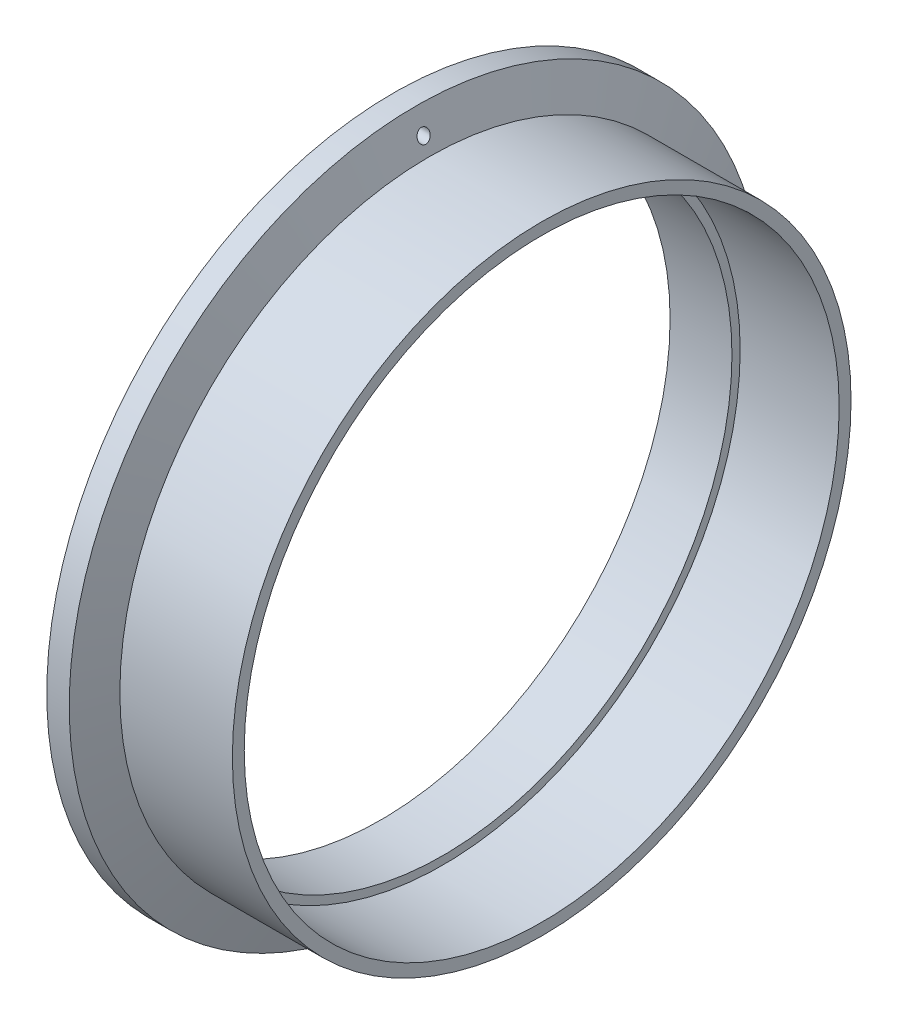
ISO-10303-21;
HEADER;
FILE_DESCRIPTION(('STEP AP214'),'2;1');
FILE_NAME('part.step','',(''),(''),'','','');
FILE_SCHEMA(('AUTOMOTIVE_DESIGN { 1 0 10303 214 1 1 1 1 }'));
ENDSEC;
DATA;
#1=APPLICATION_CONTEXT('core data for automotive mechanical design processes');
#2=APPLICATION_PROTOCOL_DEFINITION('international standard','automotive_design',2000,#1);
#3=PRODUCT_CONTEXT('',#1,'mechanical');
#4=PRODUCT('Part','Part','',(#3));
#5=PRODUCT_RELATED_PRODUCT_CATEGORY('part','',(#4));
#6=PRODUCT_DEFINITION_FORMATION('','',#4);
#7=PRODUCT_DEFINITION_CONTEXT('part definition',#1,'design');
#8=PRODUCT_DEFINITION('design','',#6,#7);
#9=PRODUCT_DEFINITION_SHAPE('','',#8);
#10=(LENGTH_UNIT() NAMED_UNIT(*) SI_UNIT(.MILLI.,.METRE.));
#11=(NAMED_UNIT(*) PLANE_ANGLE_UNIT() SI_UNIT($,.RADIAN.));
#12=(NAMED_UNIT(*) SI_UNIT($,.STERADIAN.) SOLID_ANGLE_UNIT());
#13=UNCERTAINTY_MEASURE_WITH_UNIT(LENGTH_MEASURE(1.E-05),#10,'distance_accuracy_value','');
#14=(GEOMETRIC_REPRESENTATION_CONTEXT(3) GLOBAL_UNCERTAINTY_ASSIGNED_CONTEXT((#13)) GLOBAL_UNIT_ASSIGNED_CONTEXT((#10,
#11,#12)) REPRESENTATION_CONTEXT('',''));
#15=CARTESIAN_POINT('',(0.,0.,0.));
#16=DIRECTION('',(0.,0.,1.));
#17=DIRECTION('',(1.,0.,0.));
#18=AXIS2_PLACEMENT_3D('',#15,#16,#17);
#19=CARTESIAN_POINT('',(9.23261648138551,0.,0.));
#20=DIRECTION('',(-1.,0.,0.));
#21=DIRECTION('',(0.,0.,1.));
#22=AXIS2_PLACEMENT_3D('',#19,#20,#21);
#23=CONICAL_SURFACE('',#22,79.375,1.22173047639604);
#24=CARTESIAN_POINT('',(7.36922350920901,84.4878991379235,-1.06649775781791));
#25=CARTESIAN_POINT('',(7.34869113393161,84.5451121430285,-1.00341214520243));
#26=CARTESIAN_POINT('',(7.32989380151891,84.597547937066,-0.935371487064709));
#27=CARTESIAN_POINT('',(7.2963757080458,84.6911155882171,-0.790952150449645));
#28=CARTESIAN_POINT('',(7.28165724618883,84.7322410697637,-0.714568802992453));
#29=CARTESIAN_POINT('',(7.25679867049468,84.8017340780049,-0.555340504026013));
#30=CARTESIAN_POINT('',(7.24666584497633,84.8300812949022,-0.472485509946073));
#31=CARTESIAN_POINT('',(7.23139832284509,84.8728039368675,-0.302814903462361));
#32=CARTESIAN_POINT('',(7.22626236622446,84.8871828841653,-0.216000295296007));
#33=CARTESIAN_POINT('',(7.221261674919,84.9011831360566,-0.0436522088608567));
#34=CARTESIAN_POINT('',(7.22124444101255,84.9012313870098,0.0418423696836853));
#35=CARTESIAN_POINT('',(7.22609982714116,84.8876379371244,0.211588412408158));
#36=CARTESIAN_POINT('',(7.23097208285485,84.8739972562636,0.295839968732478));
#37=CARTESIAN_POINT('',(7.24534361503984,84.8337807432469,0.4597651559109));
#38=CARTESIAN_POINT('',(7.25479061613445,84.8073510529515,0.539479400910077));
#39=CARTESIAN_POINT('',(7.27795946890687,84.742575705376,0.693232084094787));
#40=CARTESIAN_POINT('',(7.29168166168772,84.704229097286,0.767270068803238));
#41=CARTESIAN_POINT('',(7.32335923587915,84.6157826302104,0.909676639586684));
#42=CARTESIAN_POINT('',(7.34141406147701,84.5654068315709,0.977851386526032));
#43=CARTESIAN_POINT('',(7.38099316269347,84.4550918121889,1.10479578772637));
#44=CARTESIAN_POINT('',(7.402518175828,84.3951505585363,1.16356343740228));
#45=CARTESIAN_POINT('',(7.44961064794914,84.2641685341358,1.2732622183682));
#46=CARTESIAN_POINT('',(7.47532880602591,84.1927161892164,1.32363691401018));
#47=CARTESIAN_POINT('',(7.52920591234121,84.0432382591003,1.4117292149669));
#48=CARTESIAN_POINT('',(7.55736551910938,83.9652109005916,1.44944339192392));
#49=CARTESIAN_POINT('',(7.61707116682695,83.8000173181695,1.51336732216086));
#50=CARTESIAN_POINT('',(7.64871881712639,83.7125835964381,1.53879171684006));
#51=CARTESIAN_POINT('',(7.71308713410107,83.5350403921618,1.57436072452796));
#52=CARTESIAN_POINT('',(7.74580806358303,83.4449302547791,1.58450156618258));
#53=CARTESIAN_POINT('',(7.81283791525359,83.2606396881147,1.5894525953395));
#54=CARTESIAN_POINT('',(7.84715664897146,83.1664447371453,1.58361289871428));
#55=CARTESIAN_POINT('',(7.91508736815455,82.9803079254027,1.55531366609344));
#56=CARTESIAN_POINT('',(7.94869926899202,82.8883663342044,1.53285215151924));
#57=CARTESIAN_POINT('',(8.01444716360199,82.7088084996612,1.47152056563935));
#58=CARTESIAN_POINT('',(8.04657235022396,82.621223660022,1.43254652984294));
#59=CARTESIAN_POINT('',(8.10808372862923,82.4537699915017,1.3389520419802));
#60=CARTESIAN_POINT('',(8.13747029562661,82.3739001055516,1.28433373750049));
#61=CARTESIAN_POINT('',(8.1915046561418,82.2272302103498,1.1628348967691));
#62=CARTESIAN_POINT('',(8.21628079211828,82.1600748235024,1.0964414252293));
#63=CARTESIAN_POINT('',(8.26135439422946,82.038029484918,0.951888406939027));
#64=CARTESIAN_POINT('',(8.28165362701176,81.9831346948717,0.873733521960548));
#65=CARTESIAN_POINT('',(8.3158286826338,81.8907864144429,0.713000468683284));
#66=CARTESIAN_POINT('',(8.3300211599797,81.8524722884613,0.630984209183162));
#67=CARTESIAN_POINT('',(8.35309530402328,81.7902093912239,0.460970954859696));
#68=CARTESIAN_POINT('',(8.36197910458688,81.7662548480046,0.372976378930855));
#69=CARTESIAN_POINT('',(8.37369088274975,81.7346801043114,0.198964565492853));
#70=CARTESIAN_POINT('',(8.37683716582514,81.7262013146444,0.113123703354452));
#71=CARTESIAN_POINT('',(8.37792736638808,81.7232630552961,-0.0588232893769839));
#72=CARTESIAN_POINT('',(8.37587227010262,81.7288009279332,-0.144929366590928));
#73=CARTESIAN_POINT('',(8.36676581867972,81.7533491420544,-0.312682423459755));
#74=CARTESIAN_POINT('',(8.35984194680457,81.7720157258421,-0.394387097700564));
#75=CARTESIAN_POINT('',(8.34140807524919,81.8217422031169,-0.553377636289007));
#76=CARTESIAN_POINT('',(8.32989790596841,81.8528025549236,-0.630663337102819));
#77=CARTESIAN_POINT('',(8.30248354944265,81.9268396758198,-0.780100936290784));
#78=CARTESIAN_POINT('',(8.28650882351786,81.9700077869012,-0.852144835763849));
#79=CARTESIAN_POINT('',(8.25080533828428,82.066585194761,-0.98795024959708));
#80=CARTESIAN_POINT('',(8.23107583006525,82.1199965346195,-1.0517101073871));
#81=CARTESIAN_POINT('',(8.18742487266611,82.2383046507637,-1.17253140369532));
#82=CARTESIAN_POINT('',(8.16334475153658,82.3036377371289,-1.22910786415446));
#83=CARTESIAN_POINT('',(8.11246185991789,82.4418779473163,-1.33056431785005));
#84=CARTESIAN_POINT('',(8.08565833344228,82.5147871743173,-1.37544105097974));
#85=CARTESIAN_POINT('',(8.02836683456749,82.6708541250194,-1.45506698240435));
#86=CARTESIAN_POINT('',(7.9977539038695,82.7543655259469,-1.48903354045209));
#87=CARTESIAN_POINT('',(7.93514322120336,82.925440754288,-1.54232312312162));
#88=CARTESIAN_POINT('',(7.90314515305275,83.0130055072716,-1.56164278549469));
#89=CARTESIAN_POINT('',(7.83705065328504,83.1941723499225,-1.58588040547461));
#90=CARTESIAN_POINT('',(7.80292698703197,83.287863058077,-1.59006655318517));
#91=CARTESIAN_POINT('',(7.7350001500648,83.4746793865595,-1.58190932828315));
#92=CARTESIAN_POINT('',(7.70119710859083,83.567804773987,-1.56955955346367));
#93=CARTESIAN_POINT('',(7.63436071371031,83.7522334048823,-1.5282070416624));
#94=CARTESIAN_POINT('',(7.6013464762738,83.8434884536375,-1.49895760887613));
#95=CARTESIAN_POINT('',(7.53763832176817,84.0198539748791,-1.42416664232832));
#96=CARTESIAN_POINT('',(7.50694158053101,84.1049719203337,-1.37864533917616));
#97=CARTESIAN_POINT('',(7.45804037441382,84.2407522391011,-1.28916530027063));
#98=CARTESIAN_POINT('',(7.43895321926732,84.2938041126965,-1.2492568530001));
#99=CARTESIAN_POINT('',(7.40262690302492,84.3948569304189,-1.16275470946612));
#100=CARTESIAN_POINT('',(7.38538755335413,84.4428583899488,-1.11616169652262));
#101=CARTESIAN_POINT('',(7.36922350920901,84.4878991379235,-1.06649775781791));
#102=B_SPLINE_CURVE_WITH_KNOTS('',3,(#24,#25,#26,#27,#28,#29,#30,#31,#32,#33,#34,#35,#36,#37,
#38,#39,#40,#41,#42,#43,#44,#45,#46,#47,#48,#49,#50,#51,#52,#53,#54,#55,#56,#57,#58,#59,#60,#61,
#62,#63,#64,#65,#66,#67,#68,#69,#70,#71,#72,#73,#74,#75,#76,#77,#78,#79,#80,#81,#82,#83,#84,#85,
#86,#87,#88,#89,#90,#91,#92,#93,#94,#95,#96,#97,#98,#99,#100,#101),.UNSPECIFIED.,.T.,.F.,(4,2,2,
2,2,2,2,2,2,2,2,2,2,2,2,2,2,2,2,2,2,2,2,2,2,2,2,2,2,2,2,2,2,2,2,2,2,2,4),(0.,0.262582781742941,
0.525313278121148,0.78845989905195,1.05154014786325,1.30678178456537,1.56200440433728,
1.81437706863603,2.06676987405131,2.32562876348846,2.58454274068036,2.85673459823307,
3.12900010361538,3.41690646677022,3.70488386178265,4.0047445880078,4.30464101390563,
4.60645435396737,4.90822628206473,5.1996057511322,5.49087003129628,5.76434061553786,
6.0377012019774,6.29537245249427,6.55299484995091,6.8041113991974,7.05523723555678,
7.31057996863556,7.56597368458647,7.83395394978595,8.10200880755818,8.38637847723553,
8.67081340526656,8.96883147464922,9.26696496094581,9.56956459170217,9.87178930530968,
10.0785278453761,10.2852452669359),.UNSPECIFIED.);
#103=CARTESIAN_POINT('',(7.36922350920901,84.4878991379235,-1.06649775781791));
#104=VERTEX_POINT('',#103);
#105=EDGE_CURVE('E83',#104,#104,#102,.T.);
#106=ORIENTED_EDGE('',*,*,#105,.F.);
#107=EDGE_LOOP('',(#106));
#108=FACE_BOUND('',#107,.T.);
#109=CARTESIAN_POINT('',(5.7658,0.,0.));
#110=DIRECTION('',(1.,0.,0.));
#111=DIRECTION('',(0.,0.,-1.));
#112=AXIS2_PLACEMENT_3D('',#109,#110,#111);
#113=CIRCLE('',#112,88.9);
#114=CARTESIAN_POINT('',(5.7658,0.,-88.9));
#115=VERTEX_POINT('',#114);
#116=EDGE_CURVE('E10',#115,#115,#113,.T.);
#117=ORIENTED_EDGE('',*,*,#116,.T.);
#118=EDGE_LOOP('',(#117));
#119=FACE_BOUND('',#118,.T.);
#120=CARTESIAN_POINT('',(9.23261648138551,0.,0.));
#121=DIRECTION('',(1.,0.,0.));
#122=DIRECTION('',(0.,0.,-1.));
#123=AXIS2_PLACEMENT_3D('',#120,#121,#122);
#124=CIRCLE('',#123,79.375);
#125=CARTESIAN_POINT('',(9.23261648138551,0.,-79.375));
#126=VERTEX_POINT('',#125);
#127=EDGE_CURVE('E80',#126,#126,#124,.T.);
#128=ORIENTED_EDGE('',*,*,#127,.F.);
#129=EDGE_LOOP('',(#128));
#130=FACE_BOUND('',#129,.T.);
#131=ADVANCED_FACE('F36',(#108,#119,#130),#23,.T.);
#132=CARTESIAN_POINT('',(24.3299607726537,0.,0.));
#133=DIRECTION('',(1.,0.,0.));
#134=DIRECTION('',(0.,0.,-1.));
#135=AXIS2_PLACEMENT_3D('',#132,#133,#134);
#136=CYLINDRICAL_SURFACE('',#135,88.9);
#137=CARTESIAN_POINT('',(0.,0.,0.));
#138=DIRECTION('',(1.,0.,0.));
#139=DIRECTION('',(0.,0.,-1.));
#140=AXIS2_PLACEMENT_3D('',#137,#138,#139);
#141=CIRCLE('',#140,88.9);
#142=CARTESIAN_POINT('',(0.,0.,-88.9));
#143=VERTEX_POINT('',#142);
#144=EDGE_CURVE('E43',#143,#143,#141,.T.);
#145=ORIENTED_EDGE('',*,*,#144,.T.);
#146=EDGE_LOOP('',(#145));
#147=FACE_BOUND('',#146,.T.);
#148=ORIENTED_EDGE('',*,*,#116,.F.);
#149=EDGE_LOOP('',(#148));
#150=FACE_BOUND('',#149,.T.);
#151=ADVANCED_FACE('F137',(#147,#150),#136,.T.);
#152=CARTESIAN_POINT('',(0.,88.9,0.));
#153=DIRECTION('',(-1.,0.,0.));
#154=DIRECTION('',(0.,0.,1.));
#155=AXIS2_PLACEMENT_3D('',#152,#153,#154);
#156=PLANE('',#155);
#157=CARTESIAN_POINT('',(0.,83.312,0.));
#158=DIRECTION('',(-1.,0.,0.));
#159=DIRECTION('',(0.,0.,1.));
#160=AXIS2_PLACEMENT_3D('',#157,#158,#159);
#161=CIRCLE('',#160,1.5875);
#162=CARTESIAN_POINT('',(0.,83.312,1.5875));
#163=VERTEX_POINT('',#162);
#164=EDGE_CURVE('E89',#163,#163,#161,.T.);
#165=ORIENTED_EDGE('',*,*,#164,.F.);
#166=EDGE_LOOP('',(#165));
#167=FACE_BOUND('',#166,.T.);
#168=CARTESIAN_POINT('',(0.,0.,0.));
#169=DIRECTION('',(1.,0.,0.));
#170=DIRECTION('',(0.,0.,-1.));
#171=AXIS2_PLACEMENT_3D('',#168,#169,#170);
#172=CIRCLE('',#171,80.137);
#173=CARTESIAN_POINT('',(0.,0.,-80.137));
#174=VERTEX_POINT('',#173);
#175=EDGE_CURVE('E47',#174,#174,#172,.T.);
#176=ORIENTED_EDGE('',*,*,#175,.T.);
#177=EDGE_LOOP('',(#176));
#178=FACE_BOUND('',#177,.T.);
#179=ORIENTED_EDGE('',*,*,#144,.F.);
#180=EDGE_LOOP('',(#179));
#181=FACE_BOUND('',#180,.T.);
#182=ADVANCED_FACE('F134',(#167,#178,#181),#156,.T.);
#183=CARTESIAN_POINT('',(24.3299607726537,0.,0.));
#184=DIRECTION('',(1.,0.,0.));
#185=DIRECTION('',(0.,0.,-1.));
#186=AXIS2_PLACEMENT_3D('',#183,#184,#185);
#187=CYLINDRICAL_SURFACE('',#186,80.137);
#188=CARTESIAN_POINT('',(2.667,0.,0.));
#189=DIRECTION('',(1.,0.,0.));
#190=DIRECTION('',(0.,0.,-1.));
#191=AXIS2_PLACEMENT_3D('',#188,#189,#190);
#192=CIRCLE('',#191,80.137);
#193=CARTESIAN_POINT('',(2.667,0.,-80.137));
#194=VERTEX_POINT('',#193);
#195=EDGE_CURVE('E51',#194,#194,#192,.T.);
#196=ORIENTED_EDGE('',*,*,#195,.T.);
#197=EDGE_LOOP('',(#196));
#198=FACE_BOUND('',#197,.T.);
#199=ORIENTED_EDGE('',*,*,#175,.F.);
#200=EDGE_LOOP('',(#199));
#201=FACE_BOUND('',#200,.T.);
#202=ADVANCED_FACE('F130',(#198,#201),#187,.F.);
#203=CARTESIAN_POINT('',(2.667,76.073,0.));
#204=DIRECTION('',(-1.,0.,0.));
#205=DIRECTION('',(0.,0.,1.));
#206=AXIS2_PLACEMENT_3D('',#203,#204,#205);
#207=PLANE('',#206);
#208=CARTESIAN_POINT('',(2.667,0.,0.));
#209=DIRECTION('',(1.,0.,0.));
#210=DIRECTION('',(0.,0.,-1.));
#211=AXIS2_PLACEMENT_3D('',#208,#209,#210);
#212=CIRCLE('',#211,76.073);
#213=CARTESIAN_POINT('',(2.667,0.,-76.073));
#214=VERTEX_POINT('',#213);
#215=EDGE_CURVE('E56',#214,#214,#212,.T.);
#216=ORIENTED_EDGE('',*,*,#215,.T.);
#217=EDGE_LOOP('',(#216));
#218=FACE_BOUND('',#217,.T.);
#219=ORIENTED_EDGE('',*,*,#195,.F.);
#220=EDGE_LOOP('',(#219));
#221=FACE_BOUND('',#220,.T.);
#222=ADVANCED_FACE('F126',(#218,#221),#207,.T.);
#223=CARTESIAN_POINT('',(24.3299607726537,0.,0.));
#224=DIRECTION('',(1.,0.,0.));
#225=DIRECTION('',(0.,0.,-1.));
#226=AXIS2_PLACEMENT_3D('',#223,#224,#225);
#227=CYLINDRICAL_SURFACE('',#226,76.073);
#228=CARTESIAN_POINT('',(-2.667,0.,0.));
#229=DIRECTION('',(1.,0.,0.));
#230=DIRECTION('',(0.,0.,-1.));
#231=AXIS2_PLACEMENT_3D('',#228,#229,#230);
#232=CIRCLE('',#231,76.073);
#233=CARTESIAN_POINT('',(-2.667,0.,-76.073));
#234=VERTEX_POINT('',#233);
#235=EDGE_CURVE('E59',#234,#234,#232,.T.);
#236=ORIENTED_EDGE('',*,*,#235,.T.);
#237=EDGE_LOOP('',(#236));
#238=FACE_BOUND('',#237,.T.);
#239=ORIENTED_EDGE('',*,*,#215,.F.);
#240=EDGE_LOOP('',(#239));
#241=FACE_BOUND('',#240,.T.);
#242=ADVANCED_FACE('F122',(#238,#241),#227,.T.);
#243=CARTESIAN_POINT('',(-2.667,0.,0.));
#244=DIRECTION('',(1.,0.,0.));
#245=DIRECTION('',(0.,0.,-1.));
#246=AXIS2_PLACEMENT_3D('',#243,#244,#245);
#247=CONICAL_SURFACE('',#246,76.073,0.785398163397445);
#248=CARTESIAN_POINT('',(-3.175,0.,0.));
#249=DIRECTION('',(1.,0.,0.));
#250=DIRECTION('',(0.,0.,-1.));
#251=AXIS2_PLACEMENT_3D('',#248,#249,#250);
#252=CIRCLE('',#251,75.565);
#253=CARTESIAN_POINT('',(-3.175,0.,-75.565));
#254=VERTEX_POINT('',#253);
#255=EDGE_CURVE('E62',#254,#254,#252,.T.);
#256=ORIENTED_EDGE('',*,*,#255,.T.);
#257=EDGE_LOOP('',(#256));
#258=FACE_BOUND('',#257,.T.);
#259=ORIENTED_EDGE('',*,*,#235,.F.);
#260=EDGE_LOOP('',(#259));
#261=FACE_BOUND('',#260,.T.);
#262=ADVANCED_FACE('F118',(#258,#261),#247,.T.);
#263=CARTESIAN_POINT('',(-3.175,75.565,0.));
#264=DIRECTION('',(-1.,0.,0.));
#265=DIRECTION('',(0.,0.,1.));
#266=AXIS2_PLACEMENT_3D('',#263,#264,#265);
#267=PLANE('',#266);
#268=CARTESIAN_POINT('',(-3.175,0.,0.));
#269=DIRECTION('',(1.,0.,0.));
#270=DIRECTION('',(0.,0.,-1.));
#271=AXIS2_PLACEMENT_3D('',#268,#269,#270);
#272=CIRCLE('',#271,74.2188);
#273=CARTESIAN_POINT('',(-3.175,0.,-74.2188));
#274=VERTEX_POINT('',#273);
#275=EDGE_CURVE('E65',#274,#274,#272,.T.);
#276=ORIENTED_EDGE('',*,*,#275,.T.);
#277=EDGE_LOOP('',(#276));
#278=FACE_BOUND('',#277,.T.);
#279=ORIENTED_EDGE('',*,*,#255,.F.);
#280=EDGE_LOOP('',(#279));
#281=FACE_BOUND('',#280,.T.);
#282=ADVANCED_FACE('F114',(#278,#281),#267,.T.);
#283=CARTESIAN_POINT('',(24.3299607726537,0.,0.));
#284=DIRECTION('',(1.,0.,0.));
#285=DIRECTION('',(0.,0.,-1.));
#286=AXIS2_PLACEMENT_3D('',#283,#284,#285);
#287=CYLINDRICAL_SURFACE('',#286,74.2188);
#288=CARTESIAN_POINT('',(12.7,0.,0.));
#289=DIRECTION('',(1.,0.,0.));
#290=DIRECTION('',(0.,0.,-1.));
#291=AXIS2_PLACEMENT_3D('',#288,#289,#290);
#292=CIRCLE('',#291,74.2188);
#293=CARTESIAN_POINT('',(12.7,0.,-74.2188));
#294=VERTEX_POINT('',#293);
#295=EDGE_CURVE('E68',#294,#294,#292,.T.);
#296=ORIENTED_EDGE('',*,*,#295,.T.);
#297=EDGE_LOOP('',(#296));
#298=FACE_BOUND('',#297,.T.);
#299=ORIENTED_EDGE('',*,*,#275,.F.);
#300=EDGE_LOOP('',(#299));
#301=FACE_BOUND('',#300,.T.);
#302=ADVANCED_FACE('F110',(#298,#301),#287,.F.);
#303=CARTESIAN_POINT('',(12.7,76.327,0.));
#304=DIRECTION('',(1.,0.,0.));
#305=DIRECTION('',(0.,0.,-1.));
#306=AXIS2_PLACEMENT_3D('',#303,#304,#305);
#307=PLANE('',#306);
#308=CARTESIAN_POINT('',(12.7,0.,0.));
#309=DIRECTION('',(1.,0.,0.));
#310=DIRECTION('',(0.,0.,-1.));
#311=AXIS2_PLACEMENT_3D('',#308,#309,#310);
#312=CIRCLE('',#311,76.327);
#313=CARTESIAN_POINT('',(12.7,0.,-76.327));
#314=VERTEX_POINT('',#313);
#315=EDGE_CURVE('E71',#314,#314,#312,.T.);
#316=ORIENTED_EDGE('',*,*,#315,.T.);
#317=EDGE_LOOP('',(#316));
#318=FACE_BOUND('',#317,.T.);
#319=ORIENTED_EDGE('',*,*,#295,.F.);
#320=EDGE_LOOP('',(#319));
#321=FACE_BOUND('',#320,.T.);
#322=ADVANCED_FACE('F106',(#318,#321),#307,.T.);
#323=CARTESIAN_POINT('',(24.3299607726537,0.,0.));
#324=DIRECTION('',(1.,0.,0.));
#325=DIRECTION('',(0.,0.,-1.));
#326=AXIS2_PLACEMENT_3D('',#323,#324,#325);
#327=CYLINDRICAL_SURFACE('',#326,76.327);
#328=CARTESIAN_POINT('',(38.1,0.,0.));
#329=DIRECTION('',(1.,0.,0.));
#330=DIRECTION('',(0.,0.,-1.));
#331=AXIS2_PLACEMENT_3D('',#328,#329,#330);
#332=CIRCLE('',#331,76.327);
#333=CARTESIAN_POINT('',(38.1,0.,-76.327));
#334=VERTEX_POINT('',#333);
#335=EDGE_CURVE('E74',#334,#334,#332,.T.);
#336=ORIENTED_EDGE('',*,*,#335,.T.);
#337=EDGE_LOOP('',(#336));
#338=FACE_BOUND('',#337,.T.);
#339=ORIENTED_EDGE('',*,*,#315,.F.);
#340=EDGE_LOOP('',(#339));
#341=FACE_BOUND('',#340,.T.);
#342=ADVANCED_FACE('F102',(#338,#341),#327,.F.);
#343=CARTESIAN_POINT('',(38.1,76.327,0.));
#344=DIRECTION('',(1.,0.,0.));
#345=DIRECTION('',(0.,0.,-1.));
#346=AXIS2_PLACEMENT_3D('',#343,#344,#345);
#347=PLANE('',#346);
#348=CARTESIAN_POINT('',(38.1,0.,0.));
#349=DIRECTION('',(1.,0.,0.));
#350=DIRECTION('',(0.,0.,-1.));
#351=AXIS2_PLACEMENT_3D('',#348,#349,#350);
#352=CIRCLE('',#351,79.375);
#353=CARTESIAN_POINT('',(38.1,0.,-79.375));
#354=VERTEX_POINT('',#353);
#355=EDGE_CURVE('E77',#354,#354,#352,.T.);
#356=ORIENTED_EDGE('',*,*,#355,.T.);
#357=EDGE_LOOP('',(#356));
#358=FACE_BOUND('',#357,.T.);
#359=ORIENTED_EDGE('',*,*,#335,.F.);
#360=EDGE_LOOP('',(#359));
#361=FACE_BOUND('',#360,.T.);
#362=ADVANCED_FACE('F98',(#358,#361),#347,.T.);
#363=CARTESIAN_POINT('',(24.3299607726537,0.,0.));
#364=DIRECTION('',(1.,0.,0.));
#365=DIRECTION('',(0.,0.,-1.));
#366=AXIS2_PLACEMENT_3D('',#363,#364,#365);
#367=CYLINDRICAL_SURFACE('',#366,79.375);
#368=ORIENTED_EDGE('',*,*,#127,.T.);
#369=EDGE_LOOP('',(#368));
#370=FACE_BOUND('',#369,.T.);
#371=ORIENTED_EDGE('',*,*,#355,.F.);
#372=EDGE_LOOP('',(#371));
#373=FACE_BOUND('',#372,.T.);
#374=ADVANCED_FACE('F94',(#370,#373),#367,.T.);
#375=CARTESIAN_POINT('',(38.1,83.312,0.));
#376=DIRECTION('',(-1.,0.,0.));
#377=DIRECTION('',(0.,0.,1.));
#378=AXIS2_PLACEMENT_3D('',#375,#376,#377);
#379=CYLINDRICAL_SURFACE('',#378,1.5875);
#380=ORIENTED_EDGE('',*,*,#105,.T.);
#381=EDGE_LOOP('',(#380));
#382=FACE_BOUND('',#381,.T.);
#383=ORIENTED_EDGE('',*,*,#164,.T.);
#384=EDGE_LOOP('',(#383));
#385=FACE_BOUND('',#384,.T.);
#386=ADVANCED_FACE('F90',(#382,#385),#379,.F.);
#387=CLOSED_SHELL('',(#131,#151,#182,#202,#222,#242,#262,#282,#302,#322,#342,#362,#374,#386));
#388=MANIFOLD_SOLID_BREP('B2',#387);
#389=ADVANCED_BREP_SHAPE_REPRESENTATION('',(#18,#388),#14);
#390=SHAPE_DEFINITION_REPRESENTATION(#9,#389);
ENDSEC;
END-ISO-10303-21;
